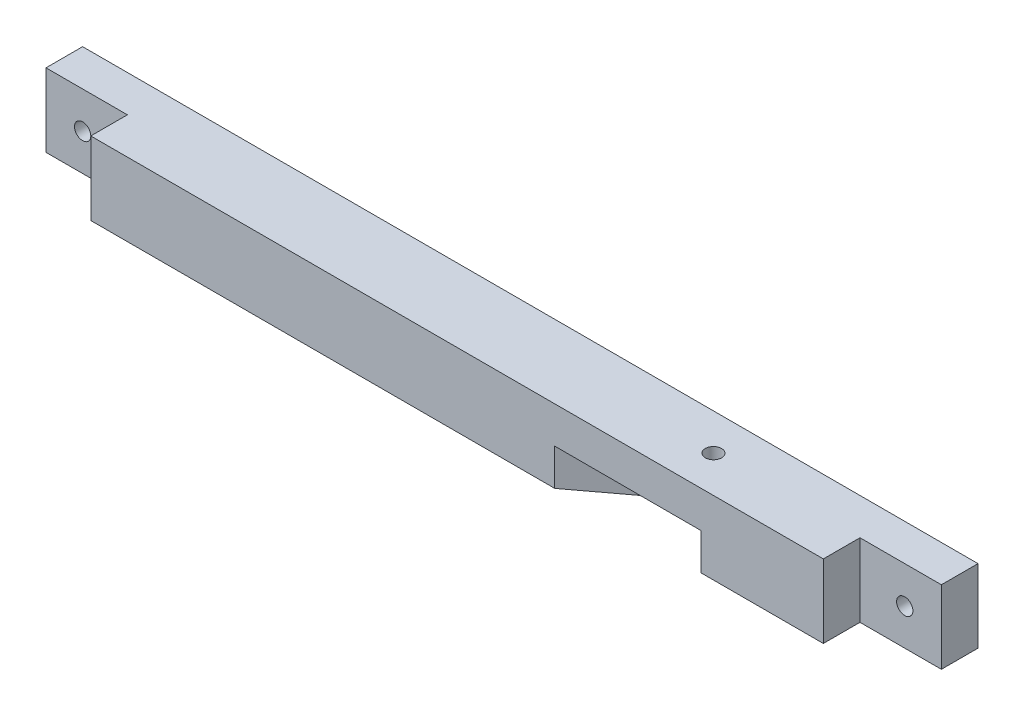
ISO-10303-21;
HEADER;
FILE_DESCRIPTION(('STEP AP214'),'2;1');
FILE_NAME('part.step','',(''),(''),'','','');
FILE_SCHEMA(('AUTOMOTIVE_DESIGN { 1 0 10303 214 1 1 1 1 }'));
ENDSEC;
DATA;
#1=APPLICATION_CONTEXT('core data for automotive mechanical design processes');
#2=APPLICATION_PROTOCOL_DEFINITION('international standard','automotive_design',2000,#1);
#3=PRODUCT_CONTEXT('',#1,'mechanical');
#4=PRODUCT('Part','Part','',(#3));
#5=PRODUCT_RELATED_PRODUCT_CATEGORY('part','',(#4));
#6=PRODUCT_DEFINITION_FORMATION('','',#4);
#7=PRODUCT_DEFINITION_CONTEXT('part definition',#1,'design');
#8=PRODUCT_DEFINITION('design','',#6,#7);
#9=PRODUCT_DEFINITION_SHAPE('','',#8);
#10=(LENGTH_UNIT() NAMED_UNIT(*) SI_UNIT(.MILLI.,.METRE.));
#11=(NAMED_UNIT(*) PLANE_ANGLE_UNIT() SI_UNIT($,.RADIAN.));
#12=(NAMED_UNIT(*) SI_UNIT($,.STERADIAN.) SOLID_ANGLE_UNIT());
#13=UNCERTAINTY_MEASURE_WITH_UNIT(LENGTH_MEASURE(1.E-05),#10,'distance_accuracy_value','');
#14=(GEOMETRIC_REPRESENTATION_CONTEXT(3) GLOBAL_UNCERTAINTY_ASSIGNED_CONTEXT((#13)) GLOBAL_UNIT_ASSIGNED_CONTEXT((#10,
#11,#12)) REPRESENTATION_CONTEXT('',''));
#15=CARTESIAN_POINT('',(0.,0.,0.));
#16=DIRECTION('',(0.,0.,1.));
#17=DIRECTION('',(1.,0.,0.));
#18=AXIS2_PLACEMENT_3D('',#15,#16,#17);
#19=CARTESIAN_POINT('',(-67.2716845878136,-109.617562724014,9.));
#20=DIRECTION('',(0.,1.,0.));
#21=DIRECTION('',(0.,0.,1.));
#22=AXIS2_PLACEMENT_3D('',#19,#20,#21);
#23=PLANE('',#22);
#24=DIRECTION('',(1.,0.,0.));
#25=VECTOR('',#24,1.);
#26=CARTESIAN_POINT('',(-67.2716845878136,-109.617562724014,0.));
#27=LINE('',#26,#25);
#28=CARTESIAN_POINT('',(-67.2716845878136,-109.617562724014,0.));
#29=VERTEX_POINT('',#28);
#30=CARTESIAN_POINT('',(11.7283154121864,-109.617562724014,0.));
#31=VERTEX_POINT('',#30);
#32=EDGE_CURVE('E205',#29,#31,#27,.T.);
#33=ORIENTED_EDGE('',*,*,#32,.T.);
#34=DIRECTION('',(0.8,0.,-0.6));
#35=VECTOR('',#34,1.);
#36=CARTESIAN_POINT('',(-0.271684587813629,-109.617562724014,9.));
#37=LINE('',#36,#35);
#38=CARTESIAN_POINT('',(-0.271684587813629,-109.617562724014,9.));
#39=VERTEX_POINT('',#38);
#40=EDGE_CURVE('E135',#39,#31,#37,.T.);
#41=ORIENTED_EDGE('',*,*,#40,.F.);
#42=DIRECTION('',(1.,0.,0.));
#43=VECTOR('',#42,1.);
#44=CARTESIAN_POINT('',(-67.2716845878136,-109.617562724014,9.));
#45=LINE('',#44,#43);
#46=CARTESIAN_POINT('',(-57.2716845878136,-109.617562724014,9.));
#47=VERTEX_POINT('',#46);
#48=EDGE_CURVE('E196',#47,#39,#45,.T.);
#49=ORIENTED_EDGE('',*,*,#48,.F.);
#50=DIRECTION('',(0.,0.,1.));
#51=VECTOR('',#50,1.);
#52=CARTESIAN_POINT('',(-57.2716845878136,-109.617562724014,4.5));
#53=LINE('',#52,#51);
#54=CARTESIAN_POINT('',(-57.2716845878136,-109.617562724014,4.5));
#55=VERTEX_POINT('',#54);
#56=EDGE_CURVE('E188',#55,#47,#53,.T.);
#57=ORIENTED_EDGE('',*,*,#56,.F.);
#58=DIRECTION('',(1.,0.,0.));
#59=VECTOR('',#58,1.);
#60=CARTESIAN_POINT('',(-67.2716845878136,-109.617562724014,4.5));
#61=LINE('',#60,#59);
#62=CARTESIAN_POINT('',(-67.2716845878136,-109.617562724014,4.5));
#63=VERTEX_POINT('',#62);
#64=EDGE_CURVE('E180',#63,#55,#61,.T.);
#65=ORIENTED_EDGE('',*,*,#64,.F.);
#66=DIRECTION('',(0.,0.,-1.));
#67=VECTOR('',#66,1.);
#68=CARTESIAN_POINT('',(-67.2716845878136,-109.617562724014,9.));
#69=LINE('',#68,#67);
#70=EDGE_CURVE('E11',#63,#29,#69,.T.);
#71=ORIENTED_EDGE('',*,*,#70,.T.);
#72=EDGE_LOOP('',(#33,#41,#49,#57,#65,#71));
#73=FACE_BOUND('',#72,.T.);
#74=ADVANCED_FACE('F31',(#73),#23,.F.);
#75=CARTESIAN_POINT('',(42.7283154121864,-109.617562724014,9.));
#76=DIRECTION('',(-1.,0.,0.));
#77=DIRECTION('',(0.,0.,1.));
#78=AXIS2_PLACEMENT_3D('',#75,#76,#77);
#79=PLANE('',#78);
#80=DIRECTION('',(0.,1.,0.));
#81=VECTOR('',#80,1.);
#82=CARTESIAN_POINT('',(42.7283154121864,-109.617562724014,4.5));
#83=LINE('',#82,#81);
#84=CARTESIAN_POINT('',(42.7283154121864,-109.617562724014,4.5));
#85=VERTEX_POINT('',#84);
#86=CARTESIAN_POINT('',(42.7283154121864,-100.617562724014,4.5));
#87=VERTEX_POINT('',#86);
#88=EDGE_CURVE('E162',#85,#87,#83,.T.);
#89=ORIENTED_EDGE('',*,*,#88,.F.);
#90=DIRECTION('',(0.,0.,-1.));
#91=VECTOR('',#90,1.);
#92=CARTESIAN_POINT('',(42.7283154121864,-109.617562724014,9.));
#93=LINE('',#92,#91);
#94=CARTESIAN_POINT('',(42.7283154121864,-109.617562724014,0.));
#95=VERTEX_POINT('',#94);
#96=EDGE_CURVE('E39',#85,#95,#93,.T.);
#97=ORIENTED_EDGE('',*,*,#96,.T.);
#98=DIRECTION('',(0.,1.,0.));
#99=VECTOR('',#98,1.);
#100=CARTESIAN_POINT('',(42.7283154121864,-109.617562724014,0.));
#101=LINE('',#100,#99);
#102=CARTESIAN_POINT('',(42.7283154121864,-100.617562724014,0.));
#103=VERTEX_POINT('',#102);
#104=EDGE_CURVE('E208',#95,#103,#101,.T.);
#105=ORIENTED_EDGE('',*,*,#104,.T.);
#106=DIRECTION('',(0.,0.,-1.));
#107=VECTOR('',#106,1.);
#108=CARTESIAN_POINT('',(42.7283154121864,-100.617562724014,9.));
#109=LINE('',#108,#107);
#110=EDGE_CURVE('E215',#87,#103,#109,.T.);
#111=ORIENTED_EDGE('',*,*,#110,.F.);
#112=EDGE_LOOP('',(#89,#97,#105,#111));
#113=FACE_BOUND('',#112,.T.);
#114=ADVANCED_FACE('F220',(#113),#79,.F.);
#115=CARTESIAN_POINT('',(-67.2716845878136,-109.617562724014,9.));
#116=DIRECTION('',(1.,0.,0.));
#117=DIRECTION('',(0.,0.,-1.));
#118=AXIS2_PLACEMENT_3D('',#115,#116,#117);
#119=PLANE('',#118);
#120=ORIENTED_EDGE('',*,*,#70,.F.);
#121=DIRECTION('',(0.,-1.,0.));
#122=VECTOR('',#121,1.);
#123=CARTESIAN_POINT('',(-67.2716845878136,-109.617562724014,4.5));
#124=LINE('',#123,#122);
#125=CARTESIAN_POINT('',(-67.2716845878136,-100.617562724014,4.5));
#126=VERTEX_POINT('',#125);
#127=EDGE_CURVE('E178',#126,#63,#124,.T.);
#128=ORIENTED_EDGE('',*,*,#127,.F.);
#129=DIRECTION('',(0.,0.,-1.));
#130=VECTOR('',#129,1.);
#131=CARTESIAN_POINT('',(-67.2716845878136,-100.617562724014,9.));
#132=LINE('',#131,#130);
#133=CARTESIAN_POINT('',(-67.2716845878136,-100.617562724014,0.));
#134=VERTEX_POINT('',#133);
#135=EDGE_CURVE('E202',#126,#134,#132,.T.);
#136=ORIENTED_EDGE('',*,*,#135,.T.);
#137=DIRECTION('',(0.,-1.,0.));
#138=VECTOR('',#137,1.);
#139=CARTESIAN_POINT('',(-67.2716845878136,-109.617562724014,0.));
#140=LINE('',#139,#138);
#141=EDGE_CURVE('E194',#134,#29,#140,.T.);
#142=ORIENTED_EDGE('',*,*,#141,.T.);
#143=EDGE_LOOP('',(#120,#128,#136,#142));
#144=FACE_BOUND('',#143,.T.);
#145=ADVANCED_FACE('F33',(#144),#119,.F.);
#146=CARTESIAN_POINT('',(17.7283154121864,-109.617562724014,9.));
#147=VERTEX_POINT('',#146);
#148=CARTESIAN_POINT('',(32.7283154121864,-109.617562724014,9.));
#149=VERTEX_POINT('',#148);
#150=EDGE_CURVE('E200',#147,#149,#45,.T.);
#151=ORIENTED_EDGE('',*,*,#150,.F.);
#152=DIRECTION('',(-0.8,0.,0.6));
#153=VECTOR('',#152,1.);
#154=CARTESIAN_POINT('',(29.7283154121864,-109.617562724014,0.));
#155=LINE('',#154,#153);
#156=CARTESIAN_POINT('',(29.7283154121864,-109.617562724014,0.));
#157=VERTEX_POINT('',#156);
#158=EDGE_CURVE('E257',#157,#147,#155,.T.);
#159=ORIENTED_EDGE('',*,*,#158,.F.);
#160=EDGE_CURVE('E141',#157,#95,#27,.T.);
#161=ORIENTED_EDGE('',*,*,#160,.T.);
#162=ORIENTED_EDGE('',*,*,#96,.F.);
#163=DIRECTION('',(1.,0.,0.));
#164=VECTOR('',#163,1.);
#165=CARTESIAN_POINT('',(42.7283154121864,-109.617562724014,4.5));
#166=LINE('',#165,#164);
#167=CARTESIAN_POINT('',(32.7283154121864,-109.617562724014,4.5));
#168=VERTEX_POINT('',#167);
#169=EDGE_CURVE('E170',#168,#85,#166,.T.);
#170=ORIENTED_EDGE('',*,*,#169,.F.);
#171=DIRECTION('',(0.,0.,1.));
#172=VECTOR('',#171,1.);
#173=CARTESIAN_POINT('',(32.7283154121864,-109.617562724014,4.5));
#174=LINE('',#173,#172);
#175=EDGE_CURVE('E173',#168,#149,#174,.T.);
#176=ORIENTED_EDGE('',*,*,#175,.T.);
#177=EDGE_LOOP('',(#151,#159,#161,#162,#170,#176));
#178=FACE_BOUND('',#177,.T.);
#179=ADVANCED_FACE('F236',(#178),#23,.F.);
#180=CARTESIAN_POINT('',(-67.2716845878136,-100.617562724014,9.));
#181=DIRECTION('',(0.,-1.,0.));
#182=DIRECTION('',(0.,0.,-1.));
#183=AXIS2_PLACEMENT_3D('',#180,#181,#182);
#184=PLANE('',#183);
#185=CARTESIAN_POINT('',(14.7283154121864,-100.617562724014,4.5));
#186=DIRECTION('',(0.,-1.,0.));
#187=DIRECTION('',(0.,0.,-1.));
#188=AXIS2_PLACEMENT_3D('',#185,#186,#187);
#189=CIRCLE('',#188,1.);
#190=CARTESIAN_POINT('',(14.7283154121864,-100.617562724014,3.5));
#191=VERTEX_POINT('',#190);
#192=EDGE_CURVE('E258',#191,#191,#189,.T.);
#193=ORIENTED_EDGE('',*,*,#192,.T.);
#194=EDGE_LOOP('',(#193));
#195=FACE_BOUND('',#194,.T.);
#196=DIRECTION('',(-1.,0.,0.));
#197=VECTOR('',#196,1.);
#198=CARTESIAN_POINT('',(-67.2716845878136,-100.617562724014,9.));
#199=LINE('',#198,#197);
#200=CARTESIAN_POINT('',(32.7283154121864,-100.617562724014,9.));
#201=VERTEX_POINT('',#200);
#202=CARTESIAN_POINT('',(-57.2716845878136,-100.617562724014,9.));
#203=VERTEX_POINT('',#202);
#204=EDGE_CURVE('E199',#201,#203,#199,.T.);
#205=ORIENTED_EDGE('',*,*,#204,.F.);
#206=DIRECTION('',(0.,0.,1.));
#207=VECTOR('',#206,1.);
#208=CARTESIAN_POINT('',(32.7283154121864,-100.617562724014,4.5));
#209=LINE('',#208,#207);
#210=CARTESIAN_POINT('',(32.7283154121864,-100.617562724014,4.5));
#211=VERTEX_POINT('',#210);
#212=EDGE_CURVE('E54',#211,#201,#209,.T.);
#213=ORIENTED_EDGE('',*,*,#212,.F.);
#214=DIRECTION('',(-1.,0.,0.));
#215=VECTOR('',#214,1.);
#216=CARTESIAN_POINT('',(42.7283154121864,-100.617562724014,4.5));
#217=LINE('',#216,#215);
#218=EDGE_CURVE('E164',#87,#211,#217,.T.);
#219=ORIENTED_EDGE('',*,*,#218,.F.);
#220=ORIENTED_EDGE('',*,*,#110,.T.);
#221=DIRECTION('',(-1.,0.,0.));
#222=VECTOR('',#221,1.);
#223=CARTESIAN_POINT('',(-67.2716845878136,-100.617562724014,0.));
#224=LINE('',#223,#222);
#225=EDGE_CURVE('E211',#103,#134,#224,.T.);
#226=ORIENTED_EDGE('',*,*,#225,.T.);
#227=ORIENTED_EDGE('',*,*,#135,.F.);
#228=DIRECTION('',(-1.,0.,0.));
#229=VECTOR('',#228,1.);
#230=CARTESIAN_POINT('',(-67.2716845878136,-100.617562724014,4.5));
#231=LINE('',#230,#229);
#232=CARTESIAN_POINT('',(-57.2716845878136,-100.617562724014,4.5));
#233=VERTEX_POINT('',#232);
#234=EDGE_CURVE('E186',#233,#126,#231,.T.);
#235=ORIENTED_EDGE('',*,*,#234,.F.);
#236=DIRECTION('',(0.,0.,1.));
#237=VECTOR('',#236,1.);
#238=CARTESIAN_POINT('',(-57.2716845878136,-100.617562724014,4.5));
#239=LINE('',#238,#237);
#240=EDGE_CURVE('E191',#233,#203,#239,.T.);
#241=ORIENTED_EDGE('',*,*,#240,.T.);
#242=EDGE_LOOP('',(#205,#213,#219,#220,#226,#227,#235,#241));
#243=FACE_BOUND('',#242,.T.);
#244=ADVANCED_FACE('F230',(#195,#243),#184,.F.);
#245=CARTESIAN_POINT('',(-67.2716845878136,-100.617562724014,9.));
#246=DIRECTION('',(0.,0.,-1.));
#247=DIRECTION('',(-1.,0.,0.));
#248=AXIS2_PLACEMENT_3D('',#245,#246,#247);
#249=PLANE('',#248);
#250=ORIENTED_EDGE('',*,*,#48,.T.);
#251=DIRECTION('',(0.,-1.,0.));
#252=VECTOR('',#251,1.);
#253=CARTESIAN_POINT('',(-0.271684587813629,-105.117562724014,9.));
#254=LINE('',#253,#252);
#255=CARTESIAN_POINT('',(-0.271684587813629,-105.117562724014,9.));
#256=VERTEX_POINT('',#255);
#257=EDGE_CURVE('E143',#256,#39,#254,.T.);
#258=ORIENTED_EDGE('',*,*,#257,.F.);
#259=DIRECTION('',(-1.,0.,0.));
#260=VECTOR('',#259,1.);
#261=CARTESIAN_POINT('',(17.7283154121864,-105.117562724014,9.));
#262=LINE('',#261,#260);
#263=CARTESIAN_POINT('',(17.7283154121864,-105.117562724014,9.));
#264=VERTEX_POINT('',#263);
#265=EDGE_CURVE('E128',#264,#256,#262,.T.);
#266=ORIENTED_EDGE('',*,*,#265,.F.);
#267=DIRECTION('',(0.,-1.,0.));
#268=VECTOR('',#267,1.);
#269=CARTESIAN_POINT('',(17.7283154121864,-105.117562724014,9.));
#270=LINE('',#269,#268);
#271=EDGE_CURVE('E126',#264,#147,#270,.T.);
#272=ORIENTED_EDGE('',*,*,#271,.T.);
#273=ORIENTED_EDGE('',*,*,#150,.T.);
#274=DIRECTION('',(0.,-1.,0.));
#275=VECTOR('',#274,1.);
#276=CARTESIAN_POINT('',(32.7283154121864,-109.617562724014,9.));
#277=LINE('',#276,#275);
#278=EDGE_CURVE('E159',#201,#149,#277,.T.);
#279=ORIENTED_EDGE('',*,*,#278,.F.);
#280=ORIENTED_EDGE('',*,*,#204,.T.);
#281=DIRECTION('',(0.,1.,0.));
#282=VECTOR('',#281,1.);
#283=CARTESIAN_POINT('',(-57.2716845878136,-109.617562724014,9.));
#284=LINE('',#283,#282);
#285=EDGE_CURVE('E176',#47,#203,#284,.T.);
#286=ORIENTED_EDGE('',*,*,#285,.F.);
#287=EDGE_LOOP('',(#250,#258,#266,#272,#273,#279,#280,#286));
#288=FACE_BOUND('',#287,.T.);
#289=ADVANCED_FACE('F239',(#288),#249,.F.);
#290=CARTESIAN_POINT('',(-67.2716845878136,-100.617562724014,0.));
#291=DIRECTION('',(0.,0.,-1.));
#292=DIRECTION('',(-1.,0.,0.));
#293=AXIS2_PLACEMENT_3D('',#290,#291,#292);
#294=PLANE('',#293);
#295=DIRECTION('',(0.,-1.,0.));
#296=VECTOR('',#295,1.);
#297=CARTESIAN_POINT('',(11.7283154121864,-105.117562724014,0.));
#298=LINE('',#297,#296);
#299=CARTESIAN_POINT('',(11.7283154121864,-105.117562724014,0.));
#300=VERTEX_POINT('',#299);
#301=EDGE_CURVE('E155',#300,#31,#298,.T.);
#302=ORIENTED_EDGE('',*,*,#301,.T.);
#303=ORIENTED_EDGE('',*,*,#32,.F.);
#304=ORIENTED_EDGE('',*,*,#141,.F.);
#305=ORIENTED_EDGE('',*,*,#225,.F.);
#306=ORIENTED_EDGE('',*,*,#104,.F.);
#307=ORIENTED_EDGE('',*,*,#160,.F.);
#308=DIRECTION('',(0.,-1.,0.));
#309=VECTOR('',#308,1.);
#310=CARTESIAN_POINT('',(29.7283154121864,-105.117562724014,0.));
#311=LINE('',#310,#309);
#312=CARTESIAN_POINT('',(29.7283154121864,-105.117562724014,0.));
#313=VERTEX_POINT('',#312);
#314=EDGE_CURVE('E123',#313,#157,#311,.T.);
#315=ORIENTED_EDGE('',*,*,#314,.F.);
#316=DIRECTION('',(1.,0.,0.));
#317=VECTOR('',#316,1.);
#318=CARTESIAN_POINT('',(11.7283154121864,-105.117562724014,0.));
#319=LINE('',#318,#317);
#320=EDGE_CURVE('E129',#300,#313,#319,.T.);
#321=ORIENTED_EDGE('',*,*,#320,.F.);
#322=EDGE_LOOP('',(#302,#303,#304,#305,#306,#307,#315,#321));
#323=FACE_BOUND('',#322,.T.);
#324=CARTESIAN_POINT('',(-62.7716845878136,-105.117562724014,0.));
#325=DIRECTION('',(0.,0.,1.));
#326=DIRECTION('',(1.,0.,0.));
#327=AXIS2_PLACEMENT_3D('',#324,#325,#326);
#328=CIRCLE('',#327,0.999999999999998);
#329=CARTESIAN_POINT('',(-61.7716845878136,-105.117562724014,0.));
#330=VERTEX_POINT('',#329);
#331=EDGE_CURVE('E148',#330,#330,#328,.T.);
#332=ORIENTED_EDGE('',*,*,#331,.T.);
#333=EDGE_LOOP('',(#332));
#334=FACE_BOUND('',#333,.T.);
#335=CARTESIAN_POINT('',(38.2284017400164,-105.145436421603,0.));
#336=DIRECTION('',(0.,0.,1.));
#337=DIRECTION('',(1.,0.,0.));
#338=AXIS2_PLACEMENT_3D('',#335,#336,#337);
#339=CIRCLE('',#338,0.999999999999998);
#340=CARTESIAN_POINT('',(39.2284017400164,-105.145436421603,0.));
#341=VERTEX_POINT('',#340);
#342=EDGE_CURVE('E156',#341,#341,#339,.T.);
#343=ORIENTED_EDGE('',*,*,#342,.T.);
#344=EDGE_LOOP('',(#343));
#345=FACE_BOUND('',#344,.T.);
#346=ADVANCED_FACE('F138',(#323,#334,#345),#294,.T.);
#347=CARTESIAN_POINT('',(-57.2716845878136,-109.617562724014,4.5));
#348=DIRECTION('',(1.,0.,0.));
#349=DIRECTION('',(0.,1.,0.));
#350=AXIS2_PLACEMENT_3D('',#347,#348,#349);
#351=PLANE('',#350);
#352=ORIENTED_EDGE('',*,*,#285,.T.);
#353=ORIENTED_EDGE('',*,*,#240,.F.);
#354=DIRECTION('',(0.,1.,0.));
#355=VECTOR('',#354,1.);
#356=CARTESIAN_POINT('',(-57.2716845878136,-109.617562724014,4.5));
#357=LINE('',#356,#355);
#358=EDGE_CURVE('E183',#55,#233,#357,.T.);
#359=ORIENTED_EDGE('',*,*,#358,.F.);
#360=ORIENTED_EDGE('',*,*,#56,.T.);
#361=EDGE_LOOP('',(#352,#353,#359,#360));
#362=FACE_BOUND('',#361,.T.);
#363=ADVANCED_FACE('F242',(#362),#351,.F.);
#364=CARTESIAN_POINT('',(-67.2716845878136,-100.617562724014,4.5));
#365=DIRECTION('',(0.,0.,-1.));
#366=DIRECTION('',(-1.,0.,0.));
#367=AXIS2_PLACEMENT_3D('',#364,#365,#366);
#368=PLANE('',#367);
#369=CARTESIAN_POINT('',(-62.7716845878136,-105.117562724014,4.5));
#370=DIRECTION('',(0.,0.,1.));
#371=DIRECTION('',(1.,0.,0.));
#372=AXIS2_PLACEMENT_3D('',#369,#370,#371);
#373=CIRCLE('',#372,0.999999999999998);
#374=CARTESIAN_POINT('',(-61.7716845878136,-105.117562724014,4.5));
#375=VERTEX_POINT('',#374);
#376=EDGE_CURVE('E152',#375,#375,#373,.T.);
#377=ORIENTED_EDGE('',*,*,#376,.F.);
#378=EDGE_LOOP('',(#377));
#379=FACE_BOUND('',#378,.T.);
#380=ORIENTED_EDGE('',*,*,#127,.T.);
#381=ORIENTED_EDGE('',*,*,#64,.T.);
#382=ORIENTED_EDGE('',*,*,#358,.T.);
#383=ORIENTED_EDGE('',*,*,#234,.T.);
#384=EDGE_LOOP('',(#380,#381,#382,#383));
#385=FACE_BOUND('',#384,.T.);
#386=ADVANCED_FACE('F244',(#379,#385),#368,.F.);
#387=CARTESIAN_POINT('',(32.7283154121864,-109.617562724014,4.5));
#388=DIRECTION('',(-1.,0.,0.));
#389=DIRECTION('',(0.,0.,1.));
#390=AXIS2_PLACEMENT_3D('',#387,#388,#389);
#391=PLANE('',#390);
#392=ORIENTED_EDGE('',*,*,#278,.T.);
#393=ORIENTED_EDGE('',*,*,#175,.F.);
#394=DIRECTION('',(0.,-1.,0.));
#395=VECTOR('',#394,1.);
#396=CARTESIAN_POINT('',(32.7283154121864,-109.617562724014,4.5));
#397=LINE('',#396,#395);
#398=EDGE_CURVE('E167',#211,#168,#397,.T.);
#399=ORIENTED_EDGE('',*,*,#398,.F.);
#400=ORIENTED_EDGE('',*,*,#212,.T.);
#401=EDGE_LOOP('',(#392,#393,#399,#400));
#402=FACE_BOUND('',#401,.T.);
#403=ADVANCED_FACE('F237',(#402),#391,.F.);
#404=CARTESIAN_POINT('',(42.7283154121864,-100.617562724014,4.5));
#405=DIRECTION('',(0.,0.,1.));
#406=DIRECTION('',(1.,0.,0.));
#407=AXIS2_PLACEMENT_3D('',#404,#405,#406);
#408=PLANE('',#407);
#409=CARTESIAN_POINT('',(38.2284017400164,-105.145436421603,4.5));
#410=DIRECTION('',(0.,0.,1.));
#411=DIRECTION('',(1.,0.,0.));
#412=AXIS2_PLACEMENT_3D('',#409,#410,#411);
#413=CIRCLE('',#412,0.999999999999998);
#414=CARTESIAN_POINT('',(39.2284017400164,-105.145436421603,4.5));
#415=VERTEX_POINT('',#414);
#416=EDGE_CURVE('E151',#415,#415,#413,.T.);
#417=ORIENTED_EDGE('',*,*,#416,.F.);
#418=EDGE_LOOP('',(#417));
#419=FACE_BOUND('',#418,.T.);
#420=ORIENTED_EDGE('',*,*,#88,.T.);
#421=ORIENTED_EDGE('',*,*,#218,.T.);
#422=ORIENTED_EDGE('',*,*,#398,.T.);
#423=ORIENTED_EDGE('',*,*,#169,.T.);
#424=EDGE_LOOP('',(#420,#421,#422,#423));
#425=FACE_BOUND('',#424,.T.);
#426=ADVANCED_FACE('F234',(#419,#425),#408,.T.);
#427=CARTESIAN_POINT('',(38.2284017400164,-105.145436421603,0.));
#428=DIRECTION('',(0.,0.,1.));
#429=DIRECTION('',(1.,0.,0.));
#430=AXIS2_PLACEMENT_3D('',#427,#428,#429);
#431=CYLINDRICAL_SURFACE('',#430,0.999999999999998);
#432=ORIENTED_EDGE('',*,*,#342,.F.);
#433=EDGE_LOOP('',(#432));
#434=FACE_BOUND('',#433,.T.);
#435=ORIENTED_EDGE('',*,*,#416,.T.);
#436=EDGE_LOOP('',(#435));
#437=FACE_BOUND('',#436,.T.);
#438=ADVANCED_FACE('F301',(#434,#437),#431,.F.);
#439=CARTESIAN_POINT('',(-62.7716845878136,-105.117562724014,0.));
#440=DIRECTION('',(0.,0.,1.));
#441=DIRECTION('',(1.,0.,0.));
#442=AXIS2_PLACEMENT_3D('',#439,#440,#441);
#443=CYLINDRICAL_SURFACE('',#442,0.999999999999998);
#444=ORIENTED_EDGE('',*,*,#331,.F.);
#445=EDGE_LOOP('',(#444));
#446=FACE_BOUND('',#445,.T.);
#447=ORIENTED_EDGE('',*,*,#376,.T.);
#448=EDGE_LOOP('',(#447));
#449=FACE_BOUND('',#448,.T.);
#450=ADVANCED_FACE('F297',(#446,#449),#443,.F.);
#451=CARTESIAN_POINT('',(-0.271684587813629,-105.117562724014,9.));
#452=DIRECTION('',(-0.6,0.,-0.8));
#453=DIRECTION('',(-0.8,0.,0.6));
#454=AXIS2_PLACEMENT_3D('',#451,#452,#453);
#455=PLANE('',#454);
#456=ORIENTED_EDGE('',*,*,#40,.T.);
#457=ORIENTED_EDGE('',*,*,#301,.F.);
#458=DIRECTION('',(0.8,0.,-0.6));
#459=VECTOR('',#458,1.);
#460=CARTESIAN_POINT('',(-0.271684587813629,-105.117562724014,9.));
#461=LINE('',#460,#459);
#462=EDGE_CURVE('E46',#256,#300,#461,.T.);
#463=ORIENTED_EDGE('',*,*,#462,.F.);
#464=ORIENTED_EDGE('',*,*,#257,.T.);
#465=EDGE_LOOP('',(#456,#457,#463,#464));
#466=FACE_BOUND('',#465,.T.);
#467=ADVANCED_FACE('F279',(#466),#455,.F.);
#468=CARTESIAN_POINT('',(29.7283154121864,-105.117562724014,0.));
#469=DIRECTION('',(0.6,0.,0.8));
#470=DIRECTION('',(0.8,0.,-0.6));
#471=AXIS2_PLACEMENT_3D('',#468,#469,#470);
#472=PLANE('',#471);
#473=ORIENTED_EDGE('',*,*,#158,.T.);
#474=ORIENTED_EDGE('',*,*,#271,.F.);
#475=DIRECTION('',(-0.8,0.,0.6));
#476=VECTOR('',#475,1.);
#477=CARTESIAN_POINT('',(29.7283154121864,-105.117562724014,0.));
#478=LINE('',#477,#476);
#479=EDGE_CURVE('E120',#313,#264,#478,.T.);
#480=ORIENTED_EDGE('',*,*,#479,.F.);
#481=ORIENTED_EDGE('',*,*,#314,.T.);
#482=EDGE_LOOP('',(#473,#474,#480,#481));
#483=FACE_BOUND('',#482,.T.);
#484=ADVANCED_FACE('F121',(#483),#472,.F.);
#485=CARTESIAN_POINT('',(29.7283154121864,-105.117562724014,0.));
#486=DIRECTION('',(0.,-1.,0.));
#487=DIRECTION('',(0.,0.,-1.));
#488=AXIS2_PLACEMENT_3D('',#485,#486,#487);
#489=PLANE('',#488);
#490=CARTESIAN_POINT('',(14.7283154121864,-105.117562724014,4.5));
#491=DIRECTION('',(0.,-1.,0.));
#492=DIRECTION('',(0.,0.,-1.));
#493=AXIS2_PLACEMENT_3D('',#490,#491,#492);
#494=CIRCLE('',#493,1.);
#495=CARTESIAN_POINT('',(14.7283154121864,-105.117562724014,3.5));
#496=VERTEX_POINT('',#495);
#497=EDGE_CURVE('E261',#496,#496,#494,.T.);
#498=ORIENTED_EDGE('',*,*,#497,.F.);
#499=EDGE_LOOP('',(#498));
#500=FACE_BOUND('',#499,.T.);
#501=ORIENTED_EDGE('',*,*,#320,.T.);
#502=ORIENTED_EDGE('',*,*,#479,.T.);
#503=ORIENTED_EDGE('',*,*,#265,.T.);
#504=ORIENTED_EDGE('',*,*,#462,.T.);
#505=EDGE_LOOP('',(#501,#502,#503,#504));
#506=FACE_BOUND('',#505,.T.);
#507=ADVANCED_FACE('F132',(#500,#506),#489,.T.);
#508=CARTESIAN_POINT('',(14.7283154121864,-100.617562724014,4.5));
#509=DIRECTION('',(0.,-1.,0.));
#510=DIRECTION('',(0.,0.,-1.));
#511=AXIS2_PLACEMENT_3D('',#508,#509,#510);
#512=CYLINDRICAL_SURFACE('',#511,1.);
#513=ORIENTED_EDGE('',*,*,#192,.F.);
#514=EDGE_LOOP('',(#513));
#515=FACE_BOUND('',#514,.T.);
#516=ORIENTED_EDGE('',*,*,#497,.T.);
#517=EDGE_LOOP('',(#516));
#518=FACE_BOUND('',#517,.T.);
#519=ADVANCED_FACE('F268',(#515,#518),#512,.F.);
#520=CLOSED_SHELL('',(#74,#114,#145,#179,#244,#289,#346,#363,#386,#403,#426,#438,#450,#467,#484,
#507,#519));
#521=MANIFOLD_SOLID_BREP('B2',#520);
#522=ADVANCED_BREP_SHAPE_REPRESENTATION('',(#18,#521),#14);
#523=SHAPE_DEFINITION_REPRESENTATION(#9,#522);
ENDSEC;
END-ISO-10303-21;
